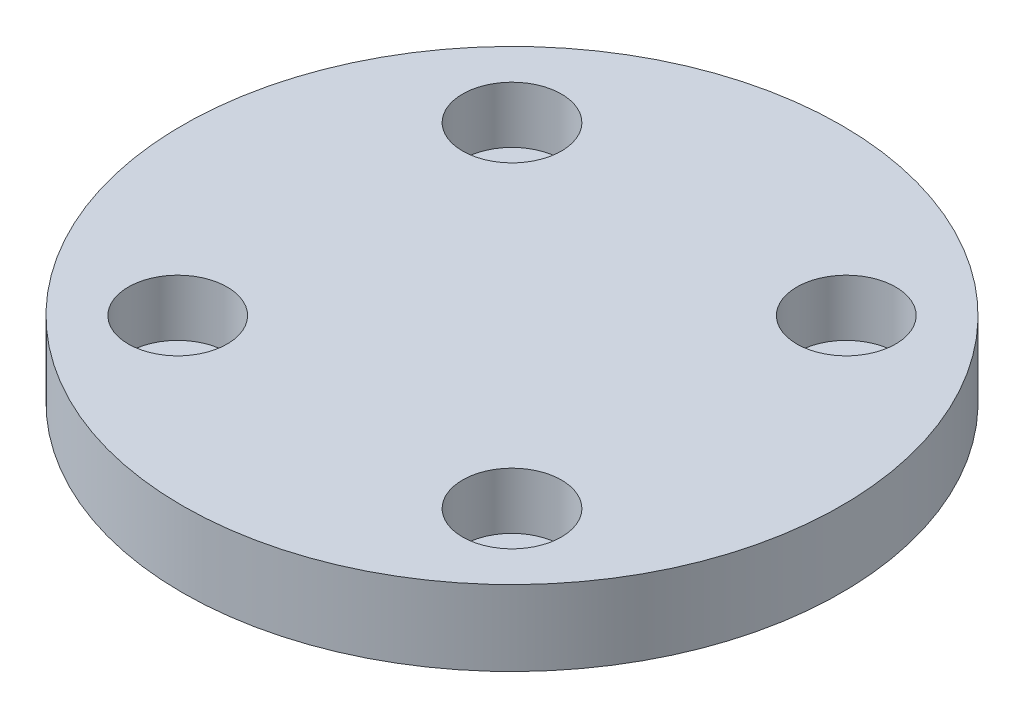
from build123d import *

# Parameters (mm, degrees)
SKETCH1_R           = 35
BOSS_EXTRUDE1_DEPTH = 8
SKETCH2_R           = 5.25
CUT_EXTRUDE1_DEPTH  = 6
SKETCH3_R           = 3.25
CUT_EXTRUDE2_DEPTH  = 2


with BuildPart() as part:
    # Sketch1 → Boss-Extrude1 (new body)
    with BuildSketch(Plane(origin=(0, 0, 0), x_dir=(1, 0, 0), z_dir=(0, 1, 0))):
        with Locations(Location((0, 0, 0), (0, 0, 270))):
            Circle(SKETCH1_R)
    extrude(amount=BOSS_EXTRUDE1_DEPTH)

    # Sketch2 → Cut-Extrude1 (cut)
    with BuildSketch(Plane(origin=(0, 8, 0), x_dir=(1, 0, 0), z_dir=(0, 1, 0))):
        with Locations(Location((-17.75, 17.75, 0), (0, 0, 270))):
            Circle(SKETCH2_R)
        with Locations(Location((17.75, 17.75, 0), (0, 0, 270))):
            Circle(SKETCH2_R)
        with Locations(Location((17.75, -17.75, 0), (0, 0, 270))):
            Circle(SKETCH2_R)
        with Locations(Location((-17.75, -17.75, 0), (0, 0, 270))):
            Circle(SKETCH2_R)
    extrude(amount=-CUT_EXTRUDE1_DEPTH, mode=Mode.SUBTRACT)

    # Sketch3 → Cut-Extrude2 (cut)
    with BuildSketch(Plane(origin=(0, 2, 0), x_dir=(1, 0, 0), z_dir=(0, 1, 0))):
        with Locations(Location((17.75, 17.75, 0), (0, 0, 270))):
            Circle(SKETCH3_R)
        with Locations(Location((-17.75, 17.75, 0), (0, 0, 270))):
            Circle(SKETCH3_R)
        with Locations(Location((-17.75, -17.75, 0), (0, 0, 270))):
            Circle(SKETCH3_R)
        with Locations(Location((17.75, -17.75, 0), (0, 0, 270))):
            Circle(SKETCH3_R)
    extrude(amount=-CUT_EXTRUDE2_DEPTH, mode=Mode.SUBTRACT)


solid = part.part
